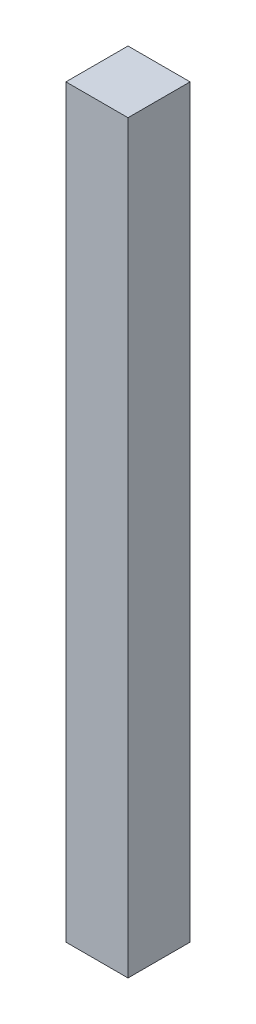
ISO-10303-21;
HEADER;
FILE_DESCRIPTION(('STEP AP214'),'2;1');
FILE_NAME('part.step','',(''),(''),'','','');
FILE_SCHEMA(('AUTOMOTIVE_DESIGN { 1 0 10303 214 1 1 1 1 }'));
ENDSEC;
DATA;
#1=APPLICATION_CONTEXT('core data for automotive mechanical design processes');
#2=APPLICATION_PROTOCOL_DEFINITION('international standard','automotive_design',2000,#1);
#3=PRODUCT_CONTEXT('',#1,'mechanical');
#4=PRODUCT('Part','Part','',(#3));
#5=PRODUCT_RELATED_PRODUCT_CATEGORY('part','',(#4));
#6=PRODUCT_DEFINITION_FORMATION('','',#4);
#7=PRODUCT_DEFINITION_CONTEXT('part definition',#1,'design');
#8=PRODUCT_DEFINITION('design','',#6,#7);
#9=PRODUCT_DEFINITION_SHAPE('','',#8);
#10=(LENGTH_UNIT() NAMED_UNIT(*) SI_UNIT(.MILLI.,.METRE.));
#11=(NAMED_UNIT(*) PLANE_ANGLE_UNIT() SI_UNIT($,.RADIAN.));
#12=(NAMED_UNIT(*) SI_UNIT($,.STERADIAN.) SOLID_ANGLE_UNIT());
#13=UNCERTAINTY_MEASURE_WITH_UNIT(LENGTH_MEASURE(1.E-05),#10,'distance_accuracy_value','');
#14=(GEOMETRIC_REPRESENTATION_CONTEXT(3) GLOBAL_UNCERTAINTY_ASSIGNED_CONTEXT((#13)) GLOBAL_UNIT_ASSIGNED_CONTEXT((#10,
#11,#12)) REPRESENTATION_CONTEXT('',''));
#15=CARTESIAN_POINT('',(0.,0.,0.));
#16=DIRECTION('',(0.,0.,1.));
#17=DIRECTION('',(1.,0.,0.));
#18=AXIS2_PLACEMENT_3D('',#15,#16,#17);
#19=CARTESIAN_POINT('',(0.,304.8,0.));
#20=DIRECTION('',(1.,0.,0.));
#21=DIRECTION('',(0.,0.,-1.));
#22=AXIS2_PLACEMENT_3D('',#19,#20,#21);
#23=PLANE('',#22);
#24=DIRECTION('',(0.,0.,1.));
#25=VECTOR('',#24,1.);
#26=CARTESIAN_POINT('',(0.,0.,0.));
#27=LINE('',#26,#25);
#28=CARTESIAN_POINT('',(0.,0.,-25.4));
#29=VERTEX_POINT('',#28);
#30=CARTESIAN_POINT('',(0.,0.,0.));
#31=VERTEX_POINT('',#30);
#32=EDGE_CURVE('E104',#29,#31,#27,.T.);
#33=ORIENTED_EDGE('',*,*,#32,.T.);
#34=DIRECTION('',(0.,-1.,0.));
#35=VECTOR('',#34,1.);
#36=CARTESIAN_POINT('',(0.,304.8,0.));
#37=LINE('',#36,#35);
#38=CARTESIAN_POINT('',(0.,304.8,0.));
#39=VERTEX_POINT('',#38);
#40=EDGE_CURVE('E11',#39,#31,#37,.T.);
#41=ORIENTED_EDGE('',*,*,#40,.F.);
#42=DIRECTION('',(0.,0.,1.));
#43=VECTOR('',#42,1.);
#44=CARTESIAN_POINT('',(0.,304.8,0.));
#45=LINE('',#44,#43);
#46=CARTESIAN_POINT('',(0.,304.8,-25.4));
#47=VERTEX_POINT('',#46);
#48=EDGE_CURVE('E92',#47,#39,#45,.T.);
#49=ORIENTED_EDGE('',*,*,#48,.F.);
#50=DIRECTION('',(0.,-1.,0.));
#51=VECTOR('',#50,1.);
#52=CARTESIAN_POINT('',(0.,304.8,-25.4));
#53=LINE('',#52,#51);
#54=EDGE_CURVE('E100',#47,#29,#53,.T.);
#55=ORIENTED_EDGE('',*,*,#54,.T.);
#56=EDGE_LOOP('',(#33,#41,#49,#55));
#57=FACE_BOUND('',#56,.T.);
#58=ADVANCED_FACE('F41',(#57),#23,.F.);
#59=CARTESIAN_POINT('',(0.,304.8,0.));
#60=DIRECTION('',(0.,0.,-1.));
#61=DIRECTION('',(-1.,0.,0.));
#62=AXIS2_PLACEMENT_3D('',#59,#60,#61);
#63=PLANE('',#62);
#64=DIRECTION('',(1.,0.,0.));
#65=VECTOR('',#64,1.);
#66=CARTESIAN_POINT('',(0.,0.,0.));
#67=LINE('',#66,#65);
#68=CARTESIAN_POINT('',(25.4,0.,0.));
#69=VERTEX_POINT('',#68);
#70=EDGE_CURVE('E96',#31,#69,#67,.T.);
#71=ORIENTED_EDGE('',*,*,#70,.T.);
#72=DIRECTION('',(0.,-1.,0.));
#73=VECTOR('',#72,1.);
#74=CARTESIAN_POINT('',(25.4,304.8,0.));
#75=LINE('',#74,#73);
#76=CARTESIAN_POINT('',(25.4,304.8,0.));
#77=VERTEX_POINT('',#76);
#78=EDGE_CURVE('E49',#77,#69,#75,.T.);
#79=ORIENTED_EDGE('',*,*,#78,.F.);
#80=DIRECTION('',(1.,0.,0.));
#81=VECTOR('',#80,1.);
#82=CARTESIAN_POINT('',(0.,304.8,0.));
#83=LINE('',#82,#81);
#84=EDGE_CURVE('E87',#39,#77,#83,.T.);
#85=ORIENTED_EDGE('',*,*,#84,.F.);
#86=ORIENTED_EDGE('',*,*,#40,.T.);
#87=EDGE_LOOP('',(#71,#79,#85,#86));
#88=FACE_BOUND('',#87,.T.);
#89=ADVANCED_FACE('F95',(#88),#63,.F.);
#90=CARTESIAN_POINT('',(25.4,304.8,0.));
#91=DIRECTION('',(-1.,0.,0.));
#92=DIRECTION('',(0.,0.,1.));
#93=AXIS2_PLACEMENT_3D('',#90,#91,#92);
#94=PLANE('',#93);
#95=DIRECTION('',(0.,0.,-1.));
#96=VECTOR('',#95,1.);
#97=CARTESIAN_POINT('',(25.4,0.,0.));
#98=LINE('',#97,#96);
#99=CARTESIAN_POINT('',(25.4,0.,-25.4));
#100=VERTEX_POINT('',#99);
#101=EDGE_CURVE('E74',#69,#100,#98,.T.);
#102=ORIENTED_EDGE('',*,*,#101,.T.);
#103=DIRECTION('',(0.,-1.,0.));
#104=VECTOR('',#103,1.);
#105=CARTESIAN_POINT('',(25.4,304.8,-25.4));
#106=LINE('',#105,#104);
#107=CARTESIAN_POINT('',(25.4,304.8,-25.4));
#108=VERTEX_POINT('',#107);
#109=EDGE_CURVE('E97',#108,#100,#106,.T.);
#110=ORIENTED_EDGE('',*,*,#109,.F.);
#111=DIRECTION('',(0.,0.,-1.));
#112=VECTOR('',#111,1.);
#113=CARTESIAN_POINT('',(25.4,304.8,0.));
#114=LINE('',#113,#112);
#115=EDGE_CURVE('E90',#77,#108,#114,.T.);
#116=ORIENTED_EDGE('',*,*,#115,.F.);
#117=ORIENTED_EDGE('',*,*,#78,.T.);
#118=EDGE_LOOP('',(#102,#110,#116,#117));
#119=FACE_BOUND('',#118,.T.);
#120=ADVANCED_FACE('F98',(#119),#94,.F.);
#121=CARTESIAN_POINT('',(0.,304.8,-25.4));
#122=DIRECTION('',(0.,0.,1.));
#123=DIRECTION('',(1.,0.,0.));
#124=AXIS2_PLACEMENT_3D('',#121,#122,#123);
#125=PLANE('',#124);
#126=DIRECTION('',(-1.,0.,0.));
#127=VECTOR('',#126,1.);
#128=CARTESIAN_POINT('',(0.,0.,-25.4));
#129=LINE('',#128,#127);
#130=EDGE_CURVE('E80',#100,#29,#129,.T.);
#131=ORIENTED_EDGE('',*,*,#130,.T.);
#132=ORIENTED_EDGE('',*,*,#54,.F.);
#133=DIRECTION('',(-1.,0.,0.));
#134=VECTOR('',#133,1.);
#135=CARTESIAN_POINT('',(0.,304.8,-25.4));
#136=LINE('',#135,#134);
#137=EDGE_CURVE('E57',#108,#47,#136,.T.);
#138=ORIENTED_EDGE('',*,*,#137,.F.);
#139=ORIENTED_EDGE('',*,*,#109,.T.);
#140=EDGE_LOOP('',(#131,#132,#138,#139));
#141=FACE_BOUND('',#140,.T.);
#142=ADVANCED_FACE('F111',(#141),#125,.F.);
#143=CARTESIAN_POINT('',(0.,304.8,0.));
#144=DIRECTION('',(0.,-1.,0.));
#145=DIRECTION('',(0.,0.,-1.));
#146=AXIS2_PLACEMENT_3D('',#143,#144,#145);
#147=PLANE('',#146);
#148=ORIENTED_EDGE('',*,*,#48,.T.);
#149=ORIENTED_EDGE('',*,*,#84,.T.);
#150=ORIENTED_EDGE('',*,*,#115,.T.);
#151=ORIENTED_EDGE('',*,*,#137,.T.);
#152=EDGE_LOOP('',(#148,#149,#150,#151));
#153=FACE_BOUND('',#152,.T.);
#154=ADVANCED_FACE('F88',(#153),#147,.F.);
#155=CARTESIAN_POINT('',(0.,0.,0.));
#156=DIRECTION('',(0.,-1.,0.));
#157=DIRECTION('',(0.,0.,-1.));
#158=AXIS2_PLACEMENT_3D('',#155,#156,#157);
#159=PLANE('',#158);
#160=ORIENTED_EDGE('',*,*,#32,.F.);
#161=ORIENTED_EDGE('',*,*,#130,.F.);
#162=ORIENTED_EDGE('',*,*,#101,.F.);
#163=ORIENTED_EDGE('',*,*,#70,.F.);
#164=EDGE_LOOP('',(#160,#161,#162,#163));
#165=FACE_BOUND('',#164,.T.);
#166=ADVANCED_FACE('F114',(#165),#159,.T.);
#167=CLOSED_SHELL('',(#58,#89,#120,#142,#154,#166));
#168=MANIFOLD_SOLID_BREP('B2',#167);
#169=ADVANCED_BREP_SHAPE_REPRESENTATION('',(#18,#168),#14);
#170=SHAPE_DEFINITION_REPRESENTATION(#9,#169);
ENDSEC;
END-ISO-10303-21;
